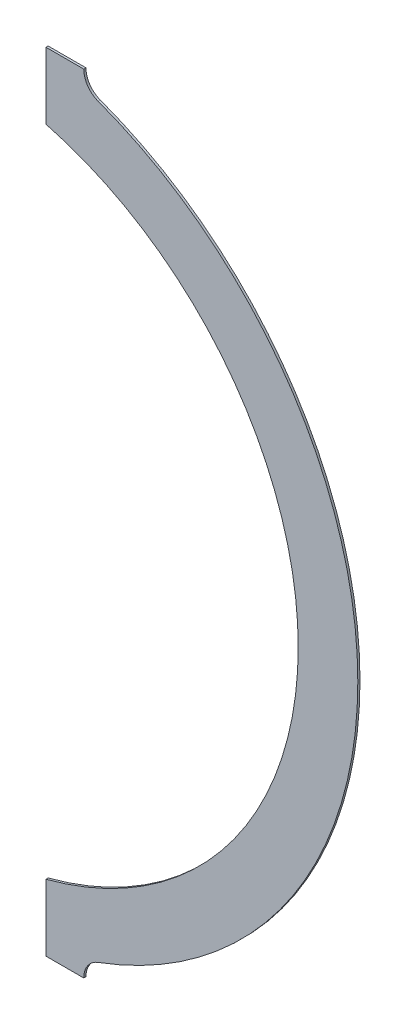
ISO-10303-21;
HEADER;
FILE_DESCRIPTION(('STEP AP214'),'2;1');
FILE_NAME('part.step','',(''),(''),'','','');
FILE_SCHEMA(('AUTOMOTIVE_DESIGN { 1 0 10303 214 1 1 1 1 }'));
ENDSEC;
DATA;
#1=APPLICATION_CONTEXT('core data for automotive mechanical design processes');
#2=APPLICATION_PROTOCOL_DEFINITION('international standard','automotive_design',2000,#1);
#3=PRODUCT_CONTEXT('',#1,'mechanical');
#4=PRODUCT('Part','Part','',(#3));
#5=PRODUCT_RELATED_PRODUCT_CATEGORY('part','',(#4));
#6=PRODUCT_DEFINITION_FORMATION('','',#4);
#7=PRODUCT_DEFINITION_CONTEXT('part definition',#1,'design');
#8=PRODUCT_DEFINITION('design','',#6,#7);
#9=PRODUCT_DEFINITION_SHAPE('','',#8);
#10=(LENGTH_UNIT() NAMED_UNIT(*) SI_UNIT(.MILLI.,.METRE.));
#11=(NAMED_UNIT(*) PLANE_ANGLE_UNIT() SI_UNIT($,.RADIAN.));
#12=(NAMED_UNIT(*) SI_UNIT($,.STERADIAN.) SOLID_ANGLE_UNIT());
#13=UNCERTAINTY_MEASURE_WITH_UNIT(LENGTH_MEASURE(1.E-05),#10,'distance_accuracy_value','');
#14=(GEOMETRIC_REPRESENTATION_CONTEXT(3) GLOBAL_UNCERTAINTY_ASSIGNED_CONTEXT((#13)) GLOBAL_UNIT_ASSIGNED_CONTEXT((#10,
#11,#12)) REPRESENTATION_CONTEXT('',''));
#15=CARTESIAN_POINT('',(0.,0.,0.));
#16=DIRECTION('',(0.,0.,1.));
#17=DIRECTION('',(1.,0.,0.));
#18=AXIS2_PLACEMENT_3D('',#15,#16,#17);
#19=CARTESIAN_POINT('',(0.,0.,0.205));
#20=DIRECTION('',(0.,0.,-1.));
#21=DIRECTION('',(-1.,0.,0.));
#22=AXIS2_PLACEMENT_3D('',#19,#20,#21);
#23=CYLINDRICAL_SURFACE('',#22,63.7588631);
#24=CARTESIAN_POINT('',(0.,0.,-0.205));
#25=DIRECTION('',(0.,0.,-1.));
#26=DIRECTION('',(1.,0.,0.));
#27=AXIS2_PLACEMENT_3D('',#24,#25,#26);
#28=CIRCLE('',#27,63.7588631);
#29=CARTESIAN_POINT('',(16.175,61.673024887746,-0.205));
#30=VERTEX_POINT('',#29);
#31=CARTESIAN_POINT('',(16.175,-61.673024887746,-0.205));
#32=VERTEX_POINT('',#31);
#33=EDGE_CURVE('E128',#30,#32,#28,.T.);
#34=ORIENTED_EDGE('',*,*,#33,.T.);
#35=DIRECTION('',(0.,0.,-1.));
#36=VECTOR('',#35,1.);
#37=CARTESIAN_POINT('',(16.175,-61.673024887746,0.205));
#38=LINE('',#37,#36);
#39=CARTESIAN_POINT('',(16.175,-61.673024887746,0.205));
#40=VERTEX_POINT('',#39);
#41=EDGE_CURVE('E11',#40,#32,#38,.T.);
#42=ORIENTED_EDGE('',*,*,#41,.F.);
#43=CARTESIAN_POINT('',(0.,0.,0.205));
#44=DIRECTION('',(0.,0.,-1.));
#45=DIRECTION('',(1.,0.,0.));
#46=AXIS2_PLACEMENT_3D('',#43,#44,#45);
#47=CIRCLE('',#46,63.7588631);
#48=CARTESIAN_POINT('',(16.175,61.673024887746,0.204999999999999));
#49=VERTEX_POINT('',#48);
#50=EDGE_CURVE('E142',#49,#40,#47,.T.);
#51=ORIENTED_EDGE('',*,*,#50,.F.);
#52=DIRECTION('',(0.,0.,-1.));
#53=VECTOR('',#52,1.);
#54=CARTESIAN_POINT('',(16.175,61.673024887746,0.204999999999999));
#55=LINE('',#54,#53);
#56=EDGE_CURVE('E124',#49,#30,#55,.T.);
#57=ORIENTED_EDGE('',*,*,#56,.T.);
#58=EDGE_LOOP('',(#34,#42,#51,#57));
#59=FACE_BOUND('',#58,.T.);
#60=ADVANCED_FACE('F32',(#59),#23,.F.);
#61=CARTESIAN_POINT('',(16.175,-61.673024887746,0.205));
#62=DIRECTION('',(1.,0.,0.));
#63=DIRECTION('',(0.,0.,-1.));
#64=AXIS2_PLACEMENT_3D('',#61,#62,#63);
#65=PLANE('',#64);
#66=DIRECTION('',(0.,-1.,0.));
#67=VECTOR('',#66,1.);
#68=CARTESIAN_POINT('',(16.175,-61.673024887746,-0.205));
#69=LINE('',#68,#67);
#70=CARTESIAN_POINT('',(16.175,-74.251052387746,-0.205));
#71=VERTEX_POINT('',#70);
#72=EDGE_CURVE('E131',#32,#71,#69,.T.);
#73=ORIENTED_EDGE('',*,*,#72,.T.);
#74=DIRECTION('',(0.,0.,-1.));
#75=VECTOR('',#74,1.);
#76=CARTESIAN_POINT('',(16.175,-74.251052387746,0.205));
#77=LINE('',#76,#75);
#78=CARTESIAN_POINT('',(16.175,-74.251052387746,0.205));
#79=VERTEX_POINT('',#78);
#80=EDGE_CURVE('E40',#79,#71,#77,.T.);
#81=ORIENTED_EDGE('',*,*,#80,.F.);
#82=DIRECTION('',(0.,-1.,0.));
#83=VECTOR('',#82,1.);
#84=CARTESIAN_POINT('',(16.175,-61.673024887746,0.205));
#85=LINE('',#84,#83);
#86=EDGE_CURVE('E91',#40,#79,#85,.T.);
#87=ORIENTED_EDGE('',*,*,#86,.F.);
#88=ORIENTED_EDGE('',*,*,#41,.T.);
#89=EDGE_LOOP('',(#73,#81,#87,#88));
#90=FACE_BOUND('',#89,.T.);
#91=ADVANCED_FACE('F177',(#90),#65,.F.);
#92=CARTESIAN_POINT('',(16.175,-74.251052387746,0.205));
#93=DIRECTION('',(0.,1.,0.));
#94=DIRECTION('',(0.,0.,1.));
#95=AXIS2_PLACEMENT_3D('',#92,#93,#94);
#96=PLANE('',#95);
#97=DIRECTION('',(1.,0.,0.));
#98=VECTOR('',#97,1.);
#99=CARTESIAN_POINT('',(16.175,-74.251052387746,-0.205));
#100=LINE('',#99,#98);
#101=CARTESIAN_POINT('',(23.295,-74.251052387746,-0.205000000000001));
#102=VERTEX_POINT('',#101);
#103=EDGE_CURVE('E133',#71,#102,#100,.T.);
#104=ORIENTED_EDGE('',*,*,#103,.T.);
#105=DIRECTION('',(0.,0.,-1.));
#106=VECTOR('',#105,1.);
#107=CARTESIAN_POINT('',(23.295,-74.251052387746,0.204999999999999));
#108=LINE('',#107,#106);
#109=CARTESIAN_POINT('',(23.295,-74.251052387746,0.204999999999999));
#110=VERTEX_POINT('',#109);
#111=EDGE_CURVE('E149',#110,#102,#108,.T.);
#112=ORIENTED_EDGE('',*,*,#111,.F.);
#113=DIRECTION('',(1.,0.,0.));
#114=VECTOR('',#113,1.);
#115=CARTESIAN_POINT('',(16.175,-74.251052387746,0.205));
#116=LINE('',#115,#114);
#117=EDGE_CURVE('E157',#79,#110,#116,.T.);
#118=ORIENTED_EDGE('',*,*,#117,.F.);
#119=ORIENTED_EDGE('',*,*,#80,.T.);
#120=EDGE_LOOP('',(#104,#112,#118,#119));
#121=FACE_BOUND('',#120,.T.);
#122=ADVANCED_FACE('F155',(#121),#96,.F.);
#123=CARTESIAN_POINT('',(27.4616744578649,-74.251052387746,0.205));
#124=DIRECTION('',(0.,0.,-1.));
#125=DIRECTION('',(-1.,0.,0.));
#126=AXIS2_PLACEMENT_3D('',#123,#124,#125);
#127=CYLINDRICAL_SURFACE('',#126,4.16667445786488);
#128=CARTESIAN_POINT('',(27.4616744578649,-74.251052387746,-0.205));
#129=DIRECTION('',(0.,0.,-1.));
#130=DIRECTION('',(-1.,0.,0.));
#131=AXIS2_PLACEMENT_3D('',#128,#129,#130);
#132=CIRCLE('',#131,4.16667445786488);
#133=CARTESIAN_POINT('',(26.0163206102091,-70.3430953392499,-0.205));
#134=VERTEX_POINT('',#133);
#135=EDGE_CURVE('E135',#102,#134,#132,.T.);
#136=ORIENTED_EDGE('',*,*,#135,.T.);
#137=DIRECTION('',(0.,0.,-1.));
#138=VECTOR('',#137,1.);
#139=CARTESIAN_POINT('',(26.0163206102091,-70.3430953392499,0.205));
#140=LINE('',#139,#138);
#141=CARTESIAN_POINT('',(26.0163206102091,-70.3430953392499,0.205));
#142=VERTEX_POINT('',#141);
#143=EDGE_CURVE('E146',#142,#134,#140,.T.);
#144=ORIENTED_EDGE('',*,*,#143,.F.);
#145=CARTESIAN_POINT('',(27.4616744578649,-74.251052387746,0.205));
#146=DIRECTION('',(0.,0.,-1.));
#147=DIRECTION('',(-1.,0.,0.));
#148=AXIS2_PLACEMENT_3D('',#145,#146,#147);
#149=CIRCLE('',#148,4.16667445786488);
#150=EDGE_CURVE('E169',#110,#142,#149,.T.);
#151=ORIENTED_EDGE('',*,*,#150,.F.);
#152=ORIENTED_EDGE('',*,*,#111,.T.);
#153=EDGE_LOOP('',(#136,#144,#151,#152));
#154=FACE_BOUND('',#153,.T.);
#155=ADVANCED_FACE('F165',(#154),#127,.F.);
#156=CARTESIAN_POINT('',(0.,0.,0.205));
#157=DIRECTION('',(0.,0.,-1.));
#158=DIRECTION('',(-1.,0.,0.));
#159=AXIS2_PLACEMENT_3D('',#156,#157,#158);
#160=CYLINDRICAL_SURFACE('',#159,75.);
#161=CARTESIAN_POINT('',(0.,0.,-0.205));
#162=DIRECTION('',(0.,0.,1.));
#163=DIRECTION('',(1.,0.,0.));
#164=AXIS2_PLACEMENT_3D('',#161,#162,#163);
#165=CIRCLE('',#164,75.);
#166=CARTESIAN_POINT('',(26.0163206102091,70.3430953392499,-0.205));
#167=VERTEX_POINT('',#166);
#168=EDGE_CURVE('E137',#134,#167,#165,.T.);
#169=ORIENTED_EDGE('',*,*,#168,.T.);
#170=DIRECTION('',(0.,0.,-1.));
#171=VECTOR('',#170,1.);
#172=CARTESIAN_POINT('',(26.0163206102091,70.3430953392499,0.205));
#173=LINE('',#172,#171);
#174=CARTESIAN_POINT('',(26.0163206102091,70.3430953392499,0.205));
#175=VERTEX_POINT('',#174);
#176=EDGE_CURVE('E119',#175,#167,#173,.T.);
#177=ORIENTED_EDGE('',*,*,#176,.F.);
#178=CARTESIAN_POINT('',(0.,0.,0.205));
#179=DIRECTION('',(0.,0.,1.));
#180=DIRECTION('',(1.,0.,0.));
#181=AXIS2_PLACEMENT_3D('',#178,#179,#180);
#182=CIRCLE('',#181,75.);
#183=EDGE_CURVE('E110',#142,#175,#182,.T.);
#184=ORIENTED_EDGE('',*,*,#183,.F.);
#185=ORIENTED_EDGE('',*,*,#143,.T.);
#186=EDGE_LOOP('',(#169,#177,#184,#185));
#187=FACE_BOUND('',#186,.T.);
#188=ADVANCED_FACE('F168',(#187),#160,.T.);
#189=CARTESIAN_POINT('',(27.4616744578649,74.251052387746,0.205));
#190=DIRECTION('',(0.,0.,-1.));
#191=DIRECTION('',(-1.,0.,0.));
#192=AXIS2_PLACEMENT_3D('',#189,#190,#191);
#193=CYLINDRICAL_SURFACE('',#192,4.16667445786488);
#194=CARTESIAN_POINT('',(27.4616744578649,74.251052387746,-0.205));
#195=DIRECTION('',(0.,0.,-1.));
#196=DIRECTION('',(1.,0.,0.));
#197=AXIS2_PLACEMENT_3D('',#194,#195,#196);
#198=CIRCLE('',#197,4.16667445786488);
#199=CARTESIAN_POINT('',(23.295,74.251052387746,-0.205000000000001));
#200=VERTEX_POINT('',#199);
#201=EDGE_CURVE('E118',#167,#200,#198,.T.);
#202=ORIENTED_EDGE('',*,*,#201,.T.);
#203=DIRECTION('',(0.,0.,-1.));
#204=VECTOR('',#203,1.);
#205=CARTESIAN_POINT('',(23.295,74.251052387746,0.204999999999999));
#206=LINE('',#205,#204);
#207=CARTESIAN_POINT('',(23.295,74.251052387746,0.204999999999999));
#208=VERTEX_POINT('',#207);
#209=EDGE_CURVE('E115',#208,#200,#206,.T.);
#210=ORIENTED_EDGE('',*,*,#209,.F.);
#211=CARTESIAN_POINT('',(27.4616744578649,74.251052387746,0.205));
#212=DIRECTION('',(0.,0.,-1.));
#213=DIRECTION('',(1.,0.,0.));
#214=AXIS2_PLACEMENT_3D('',#211,#212,#213);
#215=CIRCLE('',#214,4.16667445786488);
#216=EDGE_CURVE('E104',#175,#208,#215,.T.);
#217=ORIENTED_EDGE('',*,*,#216,.F.);
#218=ORIENTED_EDGE('',*,*,#176,.T.);
#219=EDGE_LOOP('',(#202,#210,#217,#218));
#220=FACE_BOUND('',#219,.T.);
#221=ADVANCED_FACE('F116',(#220),#193,.F.);
#222=CARTESIAN_POINT('',(16.175,74.251052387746,0.205));
#223=DIRECTION('',(0.,-1.,0.));
#224=DIRECTION('',(0.,0.,-1.));
#225=AXIS2_PLACEMENT_3D('',#222,#223,#224);
#226=PLANE('',#225);
#227=DIRECTION('',(-1.,0.,0.));
#228=VECTOR('',#227,1.);
#229=CARTESIAN_POINT('',(16.175,74.251052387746,-0.205));
#230=LINE('',#229,#228);
#231=CARTESIAN_POINT('',(16.175,74.251052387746,-0.205));
#232=VERTEX_POINT('',#231);
#233=EDGE_CURVE('E77',#200,#232,#230,.T.);
#234=ORIENTED_EDGE('',*,*,#233,.T.);
#235=DIRECTION('',(0.,0.,-1.));
#236=VECTOR('',#235,1.);
#237=CARTESIAN_POINT('',(16.175,74.251052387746,0.205));
#238=LINE('',#237,#236);
#239=CARTESIAN_POINT('',(16.175,74.251052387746,0.205));
#240=VERTEX_POINT('',#239);
#241=EDGE_CURVE('E120',#240,#232,#238,.T.);
#242=ORIENTED_EDGE('',*,*,#241,.F.);
#243=DIRECTION('',(-1.,0.,0.));
#244=VECTOR('',#243,1.);
#245=CARTESIAN_POINT('',(16.175,74.251052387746,0.205));
#246=LINE('',#245,#244);
#247=EDGE_CURVE('E108',#208,#240,#246,.T.);
#248=ORIENTED_EDGE('',*,*,#247,.F.);
#249=ORIENTED_EDGE('',*,*,#209,.T.);
#250=EDGE_LOOP('',(#234,#242,#248,#249));
#251=FACE_BOUND('',#250,.T.);
#252=ADVANCED_FACE('F122',(#251),#226,.F.);
#253=CARTESIAN_POINT('',(16.175,61.673024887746,0.204999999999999));
#254=DIRECTION('',(1.,0.,0.));
#255=DIRECTION('',(0.,1.,0.));
#256=AXIS2_PLACEMENT_3D('',#253,#254,#255);
#257=PLANE('',#256);
#258=DIRECTION('',(0.,-1.,0.));
#259=VECTOR('',#258,1.);
#260=CARTESIAN_POINT('',(16.175,61.673024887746,-0.205));
#261=LINE('',#260,#259);
#262=EDGE_CURVE('E83',#232,#30,#261,.T.);
#263=ORIENTED_EDGE('',*,*,#262,.T.);
#264=ORIENTED_EDGE('',*,*,#56,.F.);
#265=DIRECTION('',(0.,-1.,0.));
#266=VECTOR('',#265,1.);
#267=CARTESIAN_POINT('',(16.175,61.673024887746,0.204999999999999));
#268=LINE('',#267,#266);
#269=EDGE_CURVE('E48',#240,#49,#268,.T.);
#270=ORIENTED_EDGE('',*,*,#269,.F.);
#271=ORIENTED_EDGE('',*,*,#241,.T.);
#272=EDGE_LOOP('',(#263,#264,#270,#271));
#273=FACE_BOUND('',#272,.T.);
#274=ADVANCED_FACE('F193',(#273),#257,.F.);
#275=CARTESIAN_POINT('',(0.,0.,0.205));
#276=DIRECTION('',(0.,0.,1.));
#277=DIRECTION('',(1.,0.,0.));
#278=AXIS2_PLACEMENT_3D('',#275,#276,#277);
#279=PLANE('',#278);
#280=ORIENTED_EDGE('',*,*,#50,.T.);
#281=ORIENTED_EDGE('',*,*,#86,.T.);
#282=ORIENTED_EDGE('',*,*,#117,.T.);
#283=ORIENTED_EDGE('',*,*,#150,.T.);
#284=ORIENTED_EDGE('',*,*,#183,.T.);
#285=ORIENTED_EDGE('',*,*,#216,.T.);
#286=ORIENTED_EDGE('',*,*,#247,.T.);
#287=ORIENTED_EDGE('',*,*,#269,.T.);
#288=EDGE_LOOP('',(#280,#281,#282,#283,#284,#285,#286,#287));
#289=FACE_BOUND('',#288,.T.);
#290=ADVANCED_FACE('F106',(#289),#279,.T.);
#291=CARTESIAN_POINT('',(0.,0.,-0.205));
#292=DIRECTION('',(0.,0.,1.));
#293=DIRECTION('',(1.,0.,0.));
#294=AXIS2_PLACEMENT_3D('',#291,#292,#293);
#295=PLANE('',#294);
#296=ORIENTED_EDGE('',*,*,#33,.F.);
#297=ORIENTED_EDGE('',*,*,#262,.F.);
#298=ORIENTED_EDGE('',*,*,#233,.F.);
#299=ORIENTED_EDGE('',*,*,#201,.F.);
#300=ORIENTED_EDGE('',*,*,#168,.F.);
#301=ORIENTED_EDGE('',*,*,#135,.F.);
#302=ORIENTED_EDGE('',*,*,#103,.F.);
#303=ORIENTED_EDGE('',*,*,#72,.F.);
#304=EDGE_LOOP('',(#296,#297,#298,#299,#300,#301,#302,#303));
#305=FACE_BOUND('',#304,.T.);
#306=ADVANCED_FACE('F161',(#305),#295,.F.);
#307=CLOSED_SHELL('',(#60,#91,#122,#155,#188,#221,#252,#274,#290,#306));
#308=MANIFOLD_SOLID_BREP('B2',#307);
#309=ADVANCED_BREP_SHAPE_REPRESENTATION('',(#18,#308),#14);
#310=SHAPE_DEFINITION_REPRESENTATION(#9,#309);
ENDSEC;
END-ISO-10303-21;
